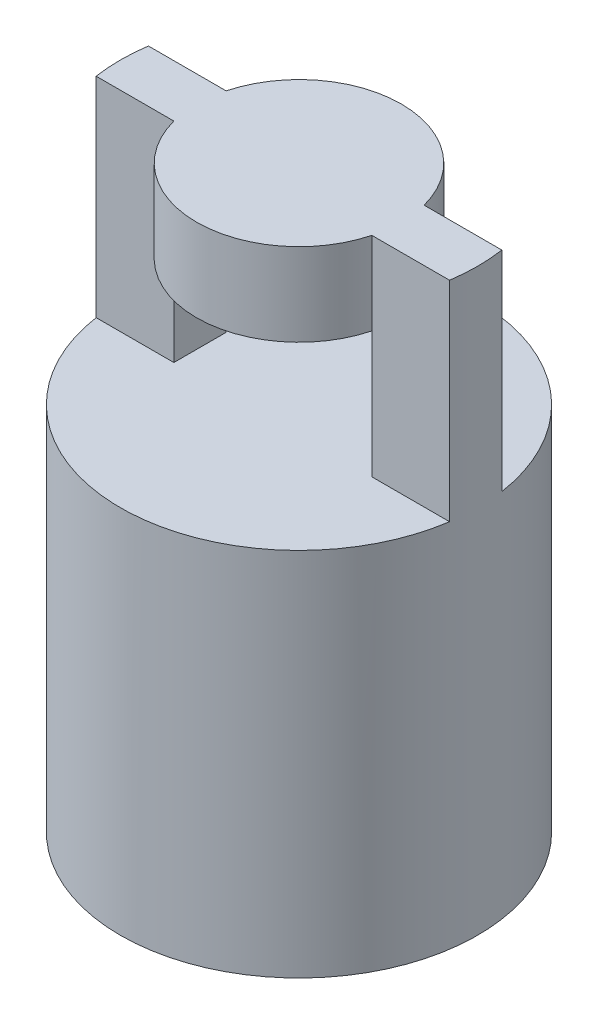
ISO-10303-21;
HEADER;
FILE_DESCRIPTION(('STEP AP214'),'2;1');
FILE_NAME('part.step','',(''),(''),'','','');
FILE_SCHEMA(('AUTOMOTIVE_DESIGN { 1 0 10303 214 1 1 1 1 }'));
ENDSEC;
DATA;
#1=APPLICATION_CONTEXT('core data for automotive mechanical design processes');
#2=APPLICATION_PROTOCOL_DEFINITION('international standard','automotive_design',2000,#1);
#3=PRODUCT_CONTEXT('',#1,'mechanical');
#4=PRODUCT('Part','Part','',(#3));
#5=PRODUCT_RELATED_PRODUCT_CATEGORY('part','',(#4));
#6=PRODUCT_DEFINITION_FORMATION('','',#4);
#7=PRODUCT_DEFINITION_CONTEXT('part definition',#1,'design');
#8=PRODUCT_DEFINITION('design','',#6,#7);
#9=PRODUCT_DEFINITION_SHAPE('','',#8);
#10=(LENGTH_UNIT() NAMED_UNIT(*) SI_UNIT(.MILLI.,.METRE.));
#11=(NAMED_UNIT(*) PLANE_ANGLE_UNIT() SI_UNIT($,.RADIAN.));
#12=(NAMED_UNIT(*) SI_UNIT($,.STERADIAN.) SOLID_ANGLE_UNIT());
#13=UNCERTAINTY_MEASURE_WITH_UNIT(LENGTH_MEASURE(1.E-05),#10,'distance_accuracy_value','');
#14=(GEOMETRIC_REPRESENTATION_CONTEXT(3) GLOBAL_UNCERTAINTY_ASSIGNED_CONTEXT((#13)) GLOBAL_UNIT_ASSIGNED_CONTEXT((#10,
#11,#12)) REPRESENTATION_CONTEXT('',''));
#15=CARTESIAN_POINT('',(0.,0.,0.));
#16=DIRECTION('',(0.,0.,1.));
#17=DIRECTION('',(1.,0.,0.));
#18=AXIS2_PLACEMENT_3D('',#15,#16,#17);
#19=CARTESIAN_POINT('',(0.,13.3,0.));
#20=DIRECTION('',(0.,-1.,0.));
#21=DIRECTION('',(0.,0.,-1.));
#22=AXIS2_PLACEMENT_3D('',#19,#20,#21);
#23=CYLINDRICAL_SURFACE('',#22,4.1);
#24=CARTESIAN_POINT('',(0.,13.3,0.));
#25=DIRECTION('',(0.,1.,0.));
#26=DIRECTION('',(0.,0.,1.));
#27=AXIS2_PLACEMENT_3D('',#24,#25,#26);
#28=CIRCLE('',#27,4.1);
#29=CARTESIAN_POINT('',(-4.05585995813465,13.3,-0.6));
#30=VERTEX_POINT('',#29);
#31=CARTESIAN_POINT('',(-4.05585995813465,13.3,0.600000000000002));
#32=VERTEX_POINT('',#31);
#33=EDGE_CURVE('E179',#30,#32,#28,.T.);
#34=ORIENTED_EDGE('',*,*,#33,.F.);
#35=DIRECTION('',(0.,1.,0.));
#36=VECTOR('',#35,1.);
#37=CARTESIAN_POINT('',(-4.05585995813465,8.5,-0.6));
#38=LINE('',#37,#36);
#39=CARTESIAN_POINT('',(-4.05585995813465,8.5,-0.6));
#40=VERTEX_POINT('',#39);
#41=EDGE_CURVE('E148',#40,#30,#38,.T.);
#42=ORIENTED_EDGE('',*,*,#41,.F.);
#43=CARTESIAN_POINT('',(0.,8.5,0.));
#44=DIRECTION('',(0.,1.,0.));
#45=DIRECTION('',(0.,0.,1.));
#46=AXIS2_PLACEMENT_3D('',#43,#44,#45);
#47=CIRCLE('',#46,4.1);
#48=CARTESIAN_POINT('',(4.05585995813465,8.5,-0.6));
#49=VERTEX_POINT('',#48);
#50=EDGE_CURVE('E126',#49,#40,#47,.T.);
#51=ORIENTED_EDGE('',*,*,#50,.F.);
#52=DIRECTION('',(0.,1.,0.));
#53=VECTOR('',#52,1.);
#54=CARTESIAN_POINT('',(4.05585995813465,8.5,-0.6));
#55=LINE('',#54,#53);
#56=CARTESIAN_POINT('',(4.05585995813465,13.3,-0.6));
#57=VERTEX_POINT('',#56);
#58=EDGE_CURVE('E111',#49,#57,#55,.T.);
#59=ORIENTED_EDGE('',*,*,#58,.T.);
#60=CARTESIAN_POINT('',(4.05585995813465,13.3,0.6));
#61=VERTEX_POINT('',#60);
#62=EDGE_CURVE('E37',#61,#57,#28,.T.);
#63=ORIENTED_EDGE('',*,*,#62,.F.);
#64=DIRECTION('',(0.,1.,0.));
#65=VECTOR('',#64,1.);
#66=CARTESIAN_POINT('',(4.05585995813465,8.5,0.6));
#67=LINE('',#66,#65);
#68=CARTESIAN_POINT('',(4.05585995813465,8.5,0.6));
#69=VERTEX_POINT('',#68);
#70=EDGE_CURVE('E170',#69,#61,#67,.T.);
#71=ORIENTED_EDGE('',*,*,#70,.F.);
#72=CARTESIAN_POINT('',(0.,8.5,0.));
#73=DIRECTION('',(0.,1.,0.));
#74=DIRECTION('',(0.,0.,-1.));
#75=AXIS2_PLACEMENT_3D('',#72,#73,#74);
#76=CIRCLE('',#75,4.1);
#77=CARTESIAN_POINT('',(-4.05585995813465,8.5,0.600000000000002));
#78=VERTEX_POINT('',#77);
#79=EDGE_CURVE('E154',#78,#69,#76,.T.);
#80=ORIENTED_EDGE('',*,*,#79,.F.);
#81=DIRECTION('',(0.,1.,0.));
#82=VECTOR('',#81,1.);
#83=CARTESIAN_POINT('',(-4.05585995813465,8.5,0.600000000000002));
#84=LINE('',#83,#82);
#85=EDGE_CURVE('E172',#78,#32,#84,.T.);
#86=ORIENTED_EDGE('',*,*,#85,.T.);
#87=EDGE_LOOP('',(#34,#42,#51,#59,#63,#71,#80,#86));
#88=FACE_BOUND('',#87,.T.);
#89=CARTESIAN_POINT('',(0.,0.,0.));
#90=DIRECTION('',(0.,1.,0.));
#91=DIRECTION('',(0.,0.,1.));
#92=AXIS2_PLACEMENT_3D('',#89,#90,#91);
#93=CIRCLE('',#92,4.1);
#94=CARTESIAN_POINT('',(0.,0.,4.1));
#95=VERTEX_POINT('',#94);
#96=EDGE_CURVE('E168',#95,#95,#93,.T.);
#97=ORIENTED_EDGE('',*,*,#96,.T.);
#98=EDGE_LOOP('',(#97));
#99=FACE_BOUND('',#98,.T.);
#100=ADVANCED_FACE('F30',(#88,#99),#23,.T.);
#101=CARTESIAN_POINT('',(0.,13.3,0.));
#102=DIRECTION('',(0.,1.,0.));
#103=DIRECTION('',(0.,0.,1.));
#104=AXIS2_PLACEMENT_3D('',#101,#102,#103);
#105=PLANE('',#104);
#106=DIRECTION('',(1.,0.,0.));
#107=VECTOR('',#106,1.);
#108=CARTESIAN_POINT('',(-4.05585995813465,13.3,-0.6));
#109=LINE('',#108,#107);
#110=CARTESIAN_POINT('',(-2.27211355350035,13.3,-0.6));
#111=VERTEX_POINT('',#110);
#112=EDGE_CURVE('E127',#30,#111,#109,.T.);
#113=ORIENTED_EDGE('',*,*,#112,.F.);
#114=ORIENTED_EDGE('',*,*,#33,.T.);
#115=DIRECTION('',(-1.,0.,0.));
#116=VECTOR('',#115,1.);
#117=CARTESIAN_POINT('',(-4.05585995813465,13.3,0.6));
#118=LINE('',#117,#116);
#119=CARTESIAN_POINT('',(-2.27211355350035,13.3,0.6));
#120=VERTEX_POINT('',#119);
#121=EDGE_CURVE('E161',#120,#32,#118,.T.);
#122=ORIENTED_EDGE('',*,*,#121,.F.);
#123=CARTESIAN_POINT('',(0.,13.3,0.));
#124=DIRECTION('',(0.,-1.,0.));
#125=DIRECTION('',(0.,0.,-1.));
#126=AXIS2_PLACEMENT_3D('',#123,#124,#125);
#127=CIRCLE('',#126,2.35);
#128=CARTESIAN_POINT('',(2.27211355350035,13.3,0.6));
#129=VERTEX_POINT('',#128);
#130=EDGE_CURVE('E146',#129,#120,#127,.T.);
#131=ORIENTED_EDGE('',*,*,#130,.F.);
#132=DIRECTION('',(-1.,0.,0.));
#133=VECTOR('',#132,1.);
#134=CARTESIAN_POINT('',(2.27211355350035,13.3,0.6));
#135=LINE('',#134,#133);
#136=EDGE_CURVE('E155',#61,#129,#135,.T.);
#137=ORIENTED_EDGE('',*,*,#136,.F.);
#138=ORIENTED_EDGE('',*,*,#62,.T.);
#139=DIRECTION('',(1.,0.,0.));
#140=VECTOR('',#139,1.);
#141=CARTESIAN_POINT('',(2.27211355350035,13.3,-0.6));
#142=LINE('',#141,#140);
#143=CARTESIAN_POINT('',(2.27211355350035,13.3,-0.6));
#144=VERTEX_POINT('',#143);
#145=EDGE_CURVE('E132',#144,#57,#142,.T.);
#146=ORIENTED_EDGE('',*,*,#145,.F.);
#147=CARTESIAN_POINT('',(0.,13.3,0.));
#148=DIRECTION('',(0.,-1.,0.));
#149=DIRECTION('',(0.,0.,1.));
#150=AXIS2_PLACEMENT_3D('',#147,#148,#149);
#151=CIRCLE('',#150,2.35);
#152=EDGE_CURVE('E140',#111,#144,#151,.T.);
#153=ORIENTED_EDGE('',*,*,#152,.F.);
#154=EDGE_LOOP('',(#113,#114,#122,#131,#137,#138,#146,#153));
#155=FACE_BOUND('',#154,.T.);
#156=ADVANCED_FACE('F187',(#155),#105,.T.);
#157=CARTESIAN_POINT('',(0.,0.,0.));
#158=DIRECTION('',(0.,1.,0.));
#159=DIRECTION('',(0.,0.,1.));
#160=AXIS2_PLACEMENT_3D('',#157,#158,#159);
#161=PLANE('',#160);
#162=CARTESIAN_POINT('',(0.,0.,0.));
#163=DIRECTION('',(0.,-1.,0.));
#164=DIRECTION('',(0.,0.,-1.));
#165=AXIS2_PLACEMENT_3D('',#162,#163,#164);
#166=CIRCLE('',#165,1.5);
#167=CARTESIAN_POINT('',(0.,0.,-1.5));
#168=VERTEX_POINT('',#167);
#169=EDGE_CURVE('E213',#168,#168,#166,.T.);
#170=ORIENTED_EDGE('',*,*,#169,.F.);
#171=EDGE_LOOP('',(#170));
#172=FACE_BOUND('',#171,.T.);
#173=ORIENTED_EDGE('',*,*,#96,.F.);
#174=EDGE_LOOP('',(#173));
#175=FACE_BOUND('',#174,.T.);
#176=ADVANCED_FACE('F224',(#172,#175),#161,.F.);
#177=CARTESIAN_POINT('',(0.,8.5,0.));
#178=DIRECTION('',(0.,1.,0.));
#179=DIRECTION('',(0.,0.,1.));
#180=AXIS2_PLACEMENT_3D('',#177,#178,#179);
#181=CYLINDRICAL_SURFACE('',#180,2.35);
#182=DIRECTION('',(0.,1.,0.));
#183=VECTOR('',#182,1.);
#184=CARTESIAN_POINT('',(-2.27211355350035,8.5,0.6));
#185=LINE('',#184,#183);
#186=CARTESIAN_POINT('',(-2.27211355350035,11.4,0.6));
#187=VERTEX_POINT('',#186);
#188=EDGE_CURVE('E158',#187,#120,#185,.T.);
#189=ORIENTED_EDGE('',*,*,#188,.F.);
#190=CARTESIAN_POINT('',(0.,11.4,0.));
#191=DIRECTION('',(0.,1.,0.));
#192=DIRECTION('',(0.,0.,1.));
#193=AXIS2_PLACEMENT_3D('',#190,#191,#192);
#194=CIRCLE('',#193,2.35);
#195=CARTESIAN_POINT('',(2.27211355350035,11.4,0.6));
#196=VERTEX_POINT('',#195);
#197=EDGE_CURVE('E135',#187,#196,#194,.T.);
#198=ORIENTED_EDGE('',*,*,#197,.T.);
#199=DIRECTION('',(0.,1.,0.));
#200=VECTOR('',#199,1.);
#201=CARTESIAN_POINT('',(2.27211355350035,8.5,0.6));
#202=LINE('',#201,#200);
#203=EDGE_CURVE('E169',#196,#129,#202,.T.);
#204=ORIENTED_EDGE('',*,*,#203,.T.);
#205=ORIENTED_EDGE('',*,*,#130,.T.);
#206=EDGE_LOOP('',(#189,#198,#204,#205));
#207=FACE_BOUND('',#206,.T.);
#208=ADVANCED_FACE('F210',(#207),#181,.T.);
#209=CARTESIAN_POINT('',(2.27211355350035,8.5,0.6));
#210=DIRECTION('',(0.,0.,-1.));
#211=DIRECTION('',(-1.,0.,0.));
#212=AXIS2_PLACEMENT_3D('',#209,#210,#211);
#213=PLANE('',#212);
#214=ORIENTED_EDGE('',*,*,#136,.T.);
#215=ORIENTED_EDGE('',*,*,#203,.F.);
#216=CARTESIAN_POINT('',(2.27211355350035,8.5,0.6));
#217=VERTEX_POINT('',#216);
#218=EDGE_CURVE('E166',#217,#196,#202,.T.);
#219=ORIENTED_EDGE('',*,*,#218,.F.);
#220=DIRECTION('',(-1.,0.,0.));
#221=VECTOR('',#220,1.);
#222=CARTESIAN_POINT('',(2.27211355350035,8.5,0.6));
#223=LINE('',#222,#221);
#224=EDGE_CURVE('E121',#69,#217,#223,.T.);
#225=ORIENTED_EDGE('',*,*,#224,.F.);
#226=ORIENTED_EDGE('',*,*,#70,.T.);
#227=EDGE_LOOP('',(#214,#215,#219,#225,#226));
#228=FACE_BOUND('',#227,.T.);
#229=ADVANCED_FACE('F201',(#228),#213,.F.);
#230=CARTESIAN_POINT('',(-4.05585995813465,8.5,0.6));
#231=DIRECTION('',(0.,0.,-1.));
#232=DIRECTION('',(-1.,0.,0.));
#233=AXIS2_PLACEMENT_3D('',#230,#231,#232);
#234=PLANE('',#233);
#235=ORIENTED_EDGE('',*,*,#121,.T.);
#236=ORIENTED_EDGE('',*,*,#85,.F.);
#237=DIRECTION('',(-1.,0.,0.));
#238=VECTOR('',#237,1.);
#239=CARTESIAN_POINT('',(-4.05585995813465,8.5,0.6));
#240=LINE('',#239,#238);
#241=CARTESIAN_POINT('',(-2.27211355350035,8.5,0.6));
#242=VERTEX_POINT('',#241);
#243=EDGE_CURVE('E151',#242,#78,#240,.T.);
#244=ORIENTED_EDGE('',*,*,#243,.F.);
#245=EDGE_CURVE('E175',#242,#187,#185,.T.);
#246=ORIENTED_EDGE('',*,*,#245,.T.);
#247=ORIENTED_EDGE('',*,*,#188,.T.);
#248=EDGE_LOOP('',(#235,#236,#244,#246,#247));
#249=FACE_BOUND('',#248,.T.);
#250=ADVANCED_FACE('F193',(#249),#234,.F.);
#251=CARTESIAN_POINT('',(0.,8.5,0.));
#252=DIRECTION('',(0.,-1.,0.));
#253=DIRECTION('',(0.,0.,-1.));
#254=AXIS2_PLACEMENT_3D('',#251,#252,#253);
#255=PLANE('',#254);
#256=ORIENTED_EDGE('',*,*,#224,.T.);
#257=DIRECTION('',(0.,0.,1.));
#258=VECTOR('',#257,1.);
#259=CARTESIAN_POINT('',(2.27211355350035,8.5,-5.));
#260=LINE('',#259,#258);
#261=CARTESIAN_POINT('',(2.27211355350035,8.5,-0.6));
#262=VERTEX_POINT('',#261);
#263=EDGE_CURVE('E107',#262,#217,#260,.T.);
#264=ORIENTED_EDGE('',*,*,#263,.F.);
#265=DIRECTION('',(1.,0.,0.));
#266=VECTOR('',#265,1.);
#267=CARTESIAN_POINT('',(2.27211355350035,8.5,-0.6));
#268=LINE('',#267,#266);
#269=EDGE_CURVE('E118',#262,#49,#268,.T.);
#270=ORIENTED_EDGE('',*,*,#269,.T.);
#271=ORIENTED_EDGE('',*,*,#50,.T.);
#272=DIRECTION('',(1.,0.,0.));
#273=VECTOR('',#272,1.);
#274=CARTESIAN_POINT('',(-4.05585995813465,8.5,-0.6));
#275=LINE('',#274,#273);
#276=CARTESIAN_POINT('',(-2.27211355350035,8.5,-0.6));
#277=VERTEX_POINT('',#276);
#278=EDGE_CURVE('E129',#40,#277,#275,.T.);
#279=ORIENTED_EDGE('',*,*,#278,.T.);
#280=DIRECTION('',(0.,0.,1.));
#281=VECTOR('',#280,1.);
#282=CARTESIAN_POINT('',(-2.27211355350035,8.5,-5.));
#283=LINE('',#282,#281);
#284=EDGE_CURVE('E122',#277,#242,#283,.T.);
#285=ORIENTED_EDGE('',*,*,#284,.T.);
#286=ORIENTED_EDGE('',*,*,#243,.T.);
#287=ORIENTED_EDGE('',*,*,#79,.T.);
#288=EDGE_LOOP('',(#256,#264,#270,#271,#279,#285,#286,#287));
#289=FACE_BOUND('',#288,.T.);
#290=ADVANCED_FACE('F117',(#289),#255,.F.);
#291=CARTESIAN_POINT('',(0.,8.5,0.));
#292=DIRECTION('',(0.,1.,0.));
#293=DIRECTION('',(0.,0.,1.));
#294=AXIS2_PLACEMENT_3D('',#291,#292,#293);
#295=CYLINDRICAL_SURFACE('',#294,2.35);
#296=DIRECTION('',(0.,1.,0.));
#297=VECTOR('',#296,1.);
#298=CARTESIAN_POINT('',(2.27211355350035,8.5,-0.6));
#299=LINE('',#298,#297);
#300=CARTESIAN_POINT('',(2.27211355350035,11.4,-0.6));
#301=VERTEX_POINT('',#300);
#302=EDGE_CURVE('E112',#301,#144,#299,.T.);
#303=ORIENTED_EDGE('',*,*,#302,.F.);
#304=CARTESIAN_POINT('',(0.,11.4,0.));
#305=DIRECTION('',(0.,1.,0.));
#306=DIRECTION('',(0.,0.,1.));
#307=AXIS2_PLACEMENT_3D('',#304,#305,#306);
#308=CIRCLE('',#307,2.35);
#309=CARTESIAN_POINT('',(-2.27211355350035,11.4,-0.6));
#310=VERTEX_POINT('',#309);
#311=EDGE_CURVE('E11',#301,#310,#308,.T.);
#312=ORIENTED_EDGE('',*,*,#311,.T.);
#313=DIRECTION('',(0.,1.,0.));
#314=VECTOR('',#313,1.);
#315=CARTESIAN_POINT('',(-2.27211355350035,8.5,-0.6));
#316=LINE('',#315,#314);
#317=EDGE_CURVE('E147',#310,#111,#316,.T.);
#318=ORIENTED_EDGE('',*,*,#317,.T.);
#319=ORIENTED_EDGE('',*,*,#152,.T.);
#320=EDGE_LOOP('',(#303,#312,#318,#319));
#321=FACE_BOUND('',#320,.T.);
#322=ADVANCED_FACE('F278',(#321),#295,.T.);
#323=CARTESIAN_POINT('',(-4.05585995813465,8.5,-0.6));
#324=DIRECTION('',(0.,0.,1.));
#325=DIRECTION('',(1.,0.,0.));
#326=AXIS2_PLACEMENT_3D('',#323,#324,#325);
#327=PLANE('',#326);
#328=ORIENTED_EDGE('',*,*,#112,.T.);
#329=ORIENTED_EDGE('',*,*,#317,.F.);
#330=EDGE_CURVE('E144',#277,#310,#316,.T.);
#331=ORIENTED_EDGE('',*,*,#330,.F.);
#332=ORIENTED_EDGE('',*,*,#278,.F.);
#333=ORIENTED_EDGE('',*,*,#41,.T.);
#334=EDGE_LOOP('',(#328,#329,#331,#332,#333));
#335=FACE_BOUND('',#334,.T.);
#336=ADVANCED_FACE('F289',(#335),#327,.F.);
#337=CARTESIAN_POINT('',(2.27211355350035,8.5,-0.6));
#338=DIRECTION('',(0.,0.,1.));
#339=DIRECTION('',(1.,0.,0.));
#340=AXIS2_PLACEMENT_3D('',#337,#338,#339);
#341=PLANE('',#340);
#342=ORIENTED_EDGE('',*,*,#145,.T.);
#343=ORIENTED_EDGE('',*,*,#58,.F.);
#344=ORIENTED_EDGE('',*,*,#269,.F.);
#345=EDGE_CURVE('E104',#262,#301,#299,.T.);
#346=ORIENTED_EDGE('',*,*,#345,.T.);
#347=ORIENTED_EDGE('',*,*,#302,.T.);
#348=EDGE_LOOP('',(#342,#343,#344,#346,#347));
#349=FACE_BOUND('',#348,.T.);
#350=ADVANCED_FACE('F124',(#349),#341,.F.);
#351=CARTESIAN_POINT('',(-2.27211355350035,11.4,-5.));
#352=DIRECTION('',(0.,1.,0.));
#353=DIRECTION('',(0.,0.,1.));
#354=AXIS2_PLACEMENT_3D('',#351,#352,#353);
#355=PLANE('',#354);
#356=DIRECTION('',(0.,0.,1.));
#357=VECTOR('',#356,1.);
#358=CARTESIAN_POINT('',(-2.27211355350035,11.4,-5.));
#359=LINE('',#358,#357);
#360=EDGE_CURVE('E44',#310,#187,#359,.T.);
#361=ORIENTED_EDGE('',*,*,#360,.F.);
#362=ORIENTED_EDGE('',*,*,#311,.F.);
#363=DIRECTION('',(0.,0.,1.));
#364=VECTOR('',#363,1.);
#365=CARTESIAN_POINT('',(2.27211355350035,11.4,-5.));
#366=LINE('',#365,#364);
#367=EDGE_CURVE('E52',#301,#196,#366,.T.);
#368=ORIENTED_EDGE('',*,*,#367,.T.);
#369=ORIENTED_EDGE('',*,*,#197,.F.);
#370=EDGE_LOOP('',(#361,#362,#368,#369));
#371=FACE_BOUND('',#370,.T.);
#372=ADVANCED_FACE('F206',(#371),#355,.F.);
#373=CARTESIAN_POINT('',(-2.27211355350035,11.4,-5.));
#374=DIRECTION('',(-1.,0.,0.));
#375=DIRECTION('',(0.,0.,1.));
#376=AXIS2_PLACEMENT_3D('',#373,#374,#375);
#377=PLANE('',#376);
#378=ORIENTED_EDGE('',*,*,#284,.F.);
#379=ORIENTED_EDGE('',*,*,#330,.T.);
#380=ORIENTED_EDGE('',*,*,#360,.T.);
#381=ORIENTED_EDGE('',*,*,#245,.F.);
#382=EDGE_LOOP('',(#378,#379,#380,#381));
#383=FACE_BOUND('',#382,.T.);
#384=ADVANCED_FACE('F312',(#383),#377,.F.);
#385=CARTESIAN_POINT('',(2.27211355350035,11.4,-5.));
#386=DIRECTION('',(1.,0.,0.));
#387=DIRECTION('',(0.,0.,-1.));
#388=AXIS2_PLACEMENT_3D('',#385,#386,#387);
#389=PLANE('',#388);
#390=ORIENTED_EDGE('',*,*,#367,.F.);
#391=ORIENTED_EDGE('',*,*,#345,.F.);
#392=ORIENTED_EDGE('',*,*,#263,.T.);
#393=ORIENTED_EDGE('',*,*,#218,.T.);
#394=EDGE_LOOP('',(#390,#391,#392,#393));
#395=FACE_BOUND('',#394,.T.);
#396=ADVANCED_FACE('F106',(#395),#389,.F.);
#397=CARTESIAN_POINT('',(0.,8.,0.));
#398=DIRECTION('',(0.,-1.,0.));
#399=DIRECTION('',(0.,0.,-1.));
#400=AXIS2_PLACEMENT_3D('',#397,#398,#399);
#401=CYLINDRICAL_SURFACE('',#400,1.5);
#402=CARTESIAN_POINT('',(0.,8.,0.));
#403=DIRECTION('',(0.,-1.,0.));
#404=DIRECTION('',(0.,0.,-1.));
#405=AXIS2_PLACEMENT_3D('',#402,#403,#404);
#406=CIRCLE('',#405,1.5);
#407=CARTESIAN_POINT('',(0.,8.,-1.5));
#408=VERTEX_POINT('',#407);
#409=EDGE_CURVE('E215',#408,#408,#406,.T.);
#410=ORIENTED_EDGE('',*,*,#409,.F.);
#411=EDGE_LOOP('',(#410));
#412=FACE_BOUND('',#411,.T.);
#413=ORIENTED_EDGE('',*,*,#169,.T.);
#414=EDGE_LOOP('',(#413));
#415=FACE_BOUND('',#414,.T.);
#416=ADVANCED_FACE('F222',(#412,#415),#401,.F.);
#417=CARTESIAN_POINT('',(0.,8.,0.));
#418=DIRECTION('',(0.,-1.,0.));
#419=DIRECTION('',(0.,0.,-1.));
#420=AXIS2_PLACEMENT_3D('',#417,#418,#419);
#421=PLANE('',#420);
#422=ORIENTED_EDGE('',*,*,#409,.T.);
#423=EDGE_LOOP('',(#422));
#424=FACE_BOUND('',#423,.T.);
#425=ADVANCED_FACE('F335',(#424),#421,.T.);
#426=CLOSED_SHELL('',(#100,#156,#176,#208,#229,#250,#290,#322,#336,#350,#372,#384,#396,#416,#425));
#427=MANIFOLD_SOLID_BREP('B2',#426);
#428=ADVANCED_BREP_SHAPE_REPRESENTATION('',(#18,#427),#14);
#429=SHAPE_DEFINITION_REPRESENTATION(#9,#428);
ENDSEC;
END-ISO-10303-21;
